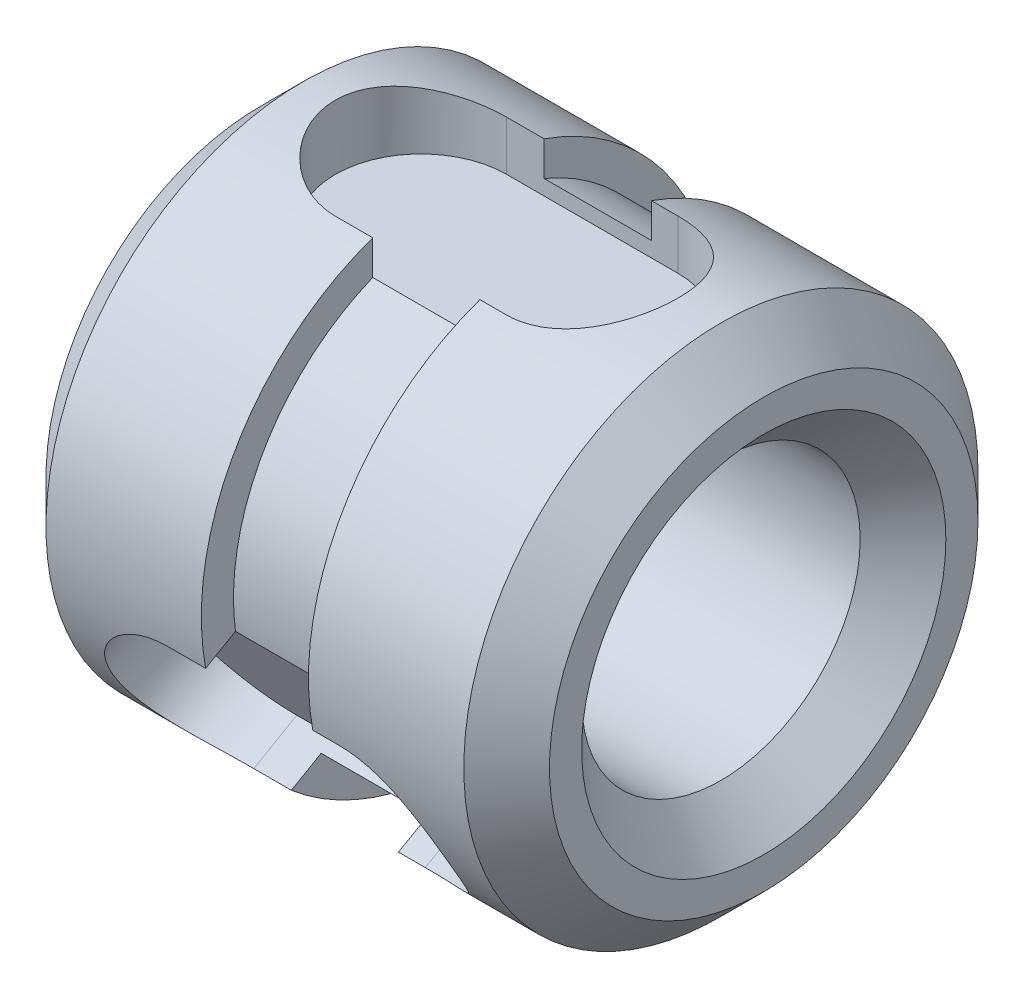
from build123d import *

# Parameters (mm, degrees)
CUT_EXTRUDE1_START = 9
CUT_EXTRUDE1_DEPTH = 20.987066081
CIRPATTERN1_COUNT  = 3
SKETCH3_W          = 5
SKETCH3_H          = 8


with BuildPart() as part:
    # Sketch1 → Revolve1 (revolve)
    with BuildSketch(Plane.XY, mode=Mode.PRIVATE) as revolve1_sk:
        Polygon((-21.5, 12), (-2, 12), (0, 10), (0, 8.5), (-2, 6.5), (-21.5, 6.5), (-23.5, 8.5), (-23.5, 10), align=None)
    revolve(revolve1_sk.sketch.rotate(Axis((0, 0, 0), (-1, 0, 0)), 90), axis=Axis((0, 0, 0), (-1, 0, 0)))

    # Sketch2 → Cut-Extrude1 (cut, through all)
    with BuildSketch(Plane(origin=(0, 0, 0), x_dir=(1, 0, 0), z_dir=(0, 1, 0)).offset(CUT_EXTRUDE1_START)):
        with BuildLine():
            Line((-16, 4), (-8, 4))
            ThreePointArc((-8, 4), (-4, 0), (-8, -4))
            Line((-8, -4), (-16, -4))
            ThreePointArc((-16, -4), (-20, 0), (-16, 4))
        make_face()
    cut_extrude1 = extrude(amount=CUT_EXTRUDE1_DEPTH, mode=Mode.SUBTRACT)

    # CirPattern1: Cut-Extrude1 ×3 about axis
    cirpattern1_axis = Axis((0, 0, 0), (1, 0, 0))
    for i in range(1, CIRPATTERN1_COUNT):
        add(cut_extrude1.rotate(cirpattern1_axis, i * 360 / CIRPATTERN1_COUNT), mode=Mode.SUBTRACT)

    # Sketch3 → Cut-Revolve1 (revolve, cut)
    with BuildSketch(Plane.XY, mode=Mode.PRIVATE) as cut_revolve1_sk:
        with Locations((-11.75, 14.5)):
            Rectangle(SKETCH3_W, SKETCH3_H)
    revolve(cut_revolve1_sk.sketch.rotate(Axis((0, 0, 0), (-1, 0, 0)), 90), axis=Axis((0, 0, 0), (-1, 0, 0)), mode=Mode.SUBTRACT)


solid = part.part
